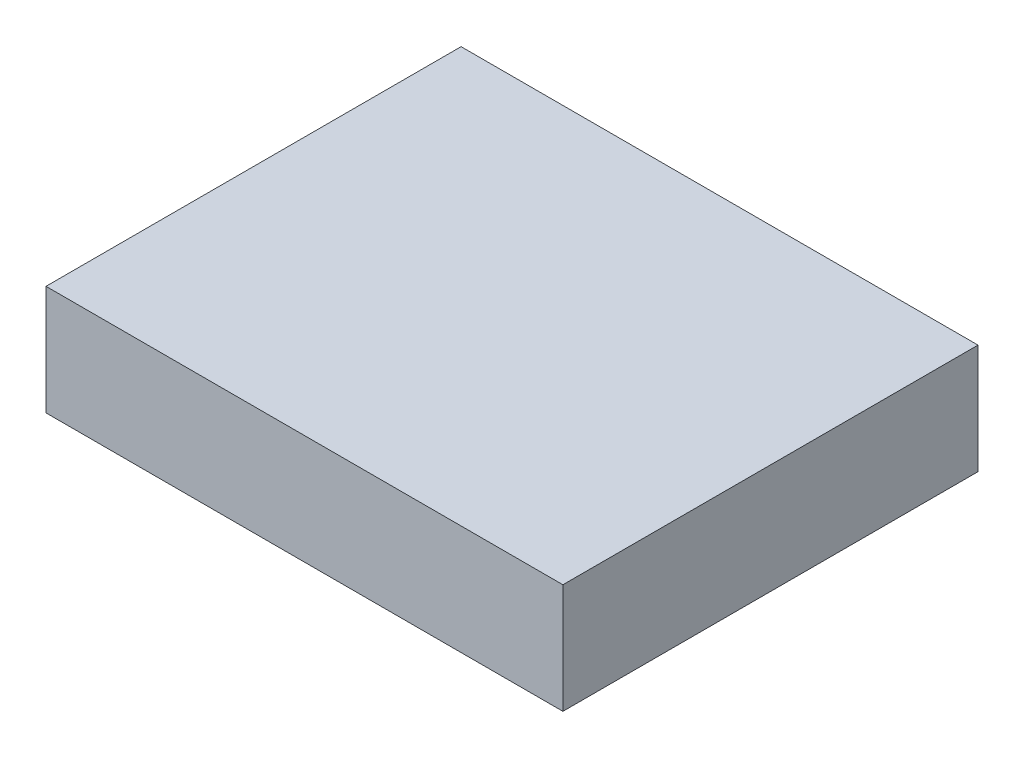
ISO-10303-21;
HEADER;
FILE_DESCRIPTION(('STEP AP214'),'2;1');
FILE_NAME('part.step','',(''),(''),'','','');
FILE_SCHEMA(('AUTOMOTIVE_DESIGN { 1 0 10303 214 1 1 1 1 }'));
ENDSEC;
DATA;
#1=APPLICATION_CONTEXT('core data for automotive mechanical design processes');
#2=APPLICATION_PROTOCOL_DEFINITION('international standard','automotive_design',2000,#1);
#3=PRODUCT_CONTEXT('',#1,'mechanical');
#4=PRODUCT('Part','Part','',(#3));
#5=PRODUCT_RELATED_PRODUCT_CATEGORY('part','',(#4));
#6=PRODUCT_DEFINITION_FORMATION('','',#4);
#7=PRODUCT_DEFINITION_CONTEXT('part definition',#1,'design');
#8=PRODUCT_DEFINITION('design','',#6,#7);
#9=PRODUCT_DEFINITION_SHAPE('','',#8);
#10=(LENGTH_UNIT() NAMED_UNIT(*) SI_UNIT(.MILLI.,.METRE.));
#11=(NAMED_UNIT(*) PLANE_ANGLE_UNIT() SI_UNIT($,.RADIAN.));
#12=(NAMED_UNIT(*) SI_UNIT($,.STERADIAN.) SOLID_ANGLE_UNIT());
#13=UNCERTAINTY_MEASURE_WITH_UNIT(LENGTH_MEASURE(1.E-05),#10,'distance_accuracy_value','');
#14=(GEOMETRIC_REPRESENTATION_CONTEXT(3) GLOBAL_UNCERTAINTY_ASSIGNED_CONTEXT((#13)) GLOBAL_UNIT_ASSIGNED_CONTEXT((#10,
#11,#12)) REPRESENTATION_CONTEXT('',''));
#15=CARTESIAN_POINT('',(0.,0.,0.));
#16=DIRECTION('',(0.,0.,1.));
#17=DIRECTION('',(1.,0.,0.));
#18=AXIS2_PLACEMENT_3D('',#15,#16,#17);
#19=CARTESIAN_POINT('',(0.,14.,0.));
#20=DIRECTION('',(1.,0.,0.));
#21=DIRECTION('',(0.,0.,-1.));
#22=AXIS2_PLACEMENT_3D('',#19,#20,#21);
#23=PLANE('',#22);
#24=DIRECTION('',(0.,0.,1.));
#25=VECTOR('',#24,1.);
#26=CARTESIAN_POINT('',(0.,0.,0.));
#27=LINE('',#26,#25);
#28=CARTESIAN_POINT('',(0.,0.,-53.));
#29=VERTEX_POINT('',#28);
#30=CARTESIAN_POINT('',(0.,0.,0.));
#31=VERTEX_POINT('',#30);
#32=EDGE_CURVE('E107',#29,#31,#27,.T.);
#33=ORIENTED_EDGE('',*,*,#32,.T.);
#34=DIRECTION('',(0.,-1.,0.));
#35=VECTOR('',#34,1.);
#36=CARTESIAN_POINT('',(0.,14.,0.));
#37=LINE('',#36,#35);
#38=CARTESIAN_POINT('',(0.,14.,0.));
#39=VERTEX_POINT('',#38);
#40=EDGE_CURVE('E11',#39,#31,#37,.T.);
#41=ORIENTED_EDGE('',*,*,#40,.F.);
#42=DIRECTION('',(0.,0.,1.));
#43=VECTOR('',#42,1.);
#44=CARTESIAN_POINT('',(0.,14.,0.));
#45=LINE('',#44,#43);
#46=CARTESIAN_POINT('',(0.,14.,-53.));
#47=VERTEX_POINT('',#46);
#48=EDGE_CURVE('E91',#47,#39,#45,.T.);
#49=ORIENTED_EDGE('',*,*,#48,.F.);
#50=DIRECTION('',(0.,-1.,0.));
#51=VECTOR('',#50,1.);
#52=CARTESIAN_POINT('',(0.,14.,-53.));
#53=LINE('',#52,#51);
#54=EDGE_CURVE('E103',#47,#29,#53,.T.);
#55=ORIENTED_EDGE('',*,*,#54,.T.);
#56=EDGE_LOOP('',(#33,#41,#49,#55));
#57=FACE_BOUND('',#56,.T.);
#58=ADVANCED_FACE('F39',(#57),#23,.F.);
#59=CARTESIAN_POINT('',(0.,14.,0.));
#60=DIRECTION('',(0.,0.,-1.));
#61=DIRECTION('',(-1.,0.,0.));
#62=AXIS2_PLACEMENT_3D('',#59,#60,#61);
#63=PLANE('',#62);
#64=DIRECTION('',(1.,0.,0.));
#65=VECTOR('',#64,1.);
#66=CARTESIAN_POINT('',(0.,0.,0.));
#67=LINE('',#66,#65);
#68=CARTESIAN_POINT('',(66.,0.,0.));
#69=VERTEX_POINT('',#68);
#70=EDGE_CURVE('E96',#31,#69,#67,.T.);
#71=ORIENTED_EDGE('',*,*,#70,.T.);
#72=DIRECTION('',(0.,-1.,0.));
#73=VECTOR('',#72,1.);
#74=CARTESIAN_POINT('',(66.,14.,0.));
#75=LINE('',#74,#73);
#76=CARTESIAN_POINT('',(66.,14.,0.));
#77=VERTEX_POINT('',#76);
#78=EDGE_CURVE('E48',#77,#69,#75,.T.);
#79=ORIENTED_EDGE('',*,*,#78,.F.);
#80=DIRECTION('',(1.,0.,0.));
#81=VECTOR('',#80,1.);
#82=CARTESIAN_POINT('',(0.,14.,0.));
#83=LINE('',#82,#81);
#84=EDGE_CURVE('E86',#39,#77,#83,.T.);
#85=ORIENTED_EDGE('',*,*,#84,.F.);
#86=ORIENTED_EDGE('',*,*,#40,.T.);
#87=EDGE_LOOP('',(#71,#79,#85,#86));
#88=FACE_BOUND('',#87,.T.);
#89=ADVANCED_FACE('F95',(#88),#63,.F.);
#90=CARTESIAN_POINT('',(66.,14.,0.));
#91=DIRECTION('',(-1.,0.,0.));
#92=DIRECTION('',(0.,0.,1.));
#93=AXIS2_PLACEMENT_3D('',#90,#91,#92);
#94=PLANE('',#93);
#95=DIRECTION('',(0.,0.,-1.));
#96=VECTOR('',#95,1.);
#97=CARTESIAN_POINT('',(66.,0.,0.));
#98=LINE('',#97,#96);
#99=CARTESIAN_POINT('',(66.,0.,-53.));
#100=VERTEX_POINT('',#99);
#101=EDGE_CURVE('E73',#69,#100,#98,.T.);
#102=ORIENTED_EDGE('',*,*,#101,.T.);
#103=DIRECTION('',(0.,-1.,0.));
#104=VECTOR('',#103,1.);
#105=CARTESIAN_POINT('',(66.,14.,-53.));
#106=LINE('',#105,#104);
#107=CARTESIAN_POINT('',(66.,14.,-53.));
#108=VERTEX_POINT('',#107);
#109=EDGE_CURVE('E98',#108,#100,#106,.T.);
#110=ORIENTED_EDGE('',*,*,#109,.F.);
#111=DIRECTION('',(0.,0.,-1.));
#112=VECTOR('',#111,1.);
#113=CARTESIAN_POINT('',(66.,14.,0.));
#114=LINE('',#113,#112);
#115=EDGE_CURVE('E89',#77,#108,#114,.T.);
#116=ORIENTED_EDGE('',*,*,#115,.F.);
#117=ORIENTED_EDGE('',*,*,#78,.T.);
#118=EDGE_LOOP('',(#102,#110,#116,#117));
#119=FACE_BOUND('',#118,.T.);
#120=ADVANCED_FACE('F99',(#119),#94,.F.);
#121=CARTESIAN_POINT('',(0.,14.,-53.));
#122=DIRECTION('',(0.,0.,1.));
#123=DIRECTION('',(1.,0.,0.));
#124=AXIS2_PLACEMENT_3D('',#121,#122,#123);
#125=PLANE('',#124);
#126=DIRECTION('',(-1.,0.,0.));
#127=VECTOR('',#126,1.);
#128=CARTESIAN_POINT('',(0.,0.,-53.));
#129=LINE('',#128,#127);
#130=EDGE_CURVE('E79',#100,#29,#129,.T.);
#131=ORIENTED_EDGE('',*,*,#130,.T.);
#132=ORIENTED_EDGE('',*,*,#54,.F.);
#133=DIRECTION('',(-1.,0.,0.));
#134=VECTOR('',#133,1.);
#135=CARTESIAN_POINT('',(0.,14.,-53.));
#136=LINE('',#135,#134);
#137=EDGE_CURVE('E56',#108,#47,#136,.T.);
#138=ORIENTED_EDGE('',*,*,#137,.F.);
#139=ORIENTED_EDGE('',*,*,#109,.T.);
#140=EDGE_LOOP('',(#131,#132,#138,#139));
#141=FACE_BOUND('',#140,.T.);
#142=ADVANCED_FACE('F120',(#141),#125,.F.);
#143=CARTESIAN_POINT('',(0.,14.,0.));
#144=DIRECTION('',(0.,-1.,0.));
#145=DIRECTION('',(0.,0.,-1.));
#146=AXIS2_PLACEMENT_3D('',#143,#144,#145);
#147=PLANE('',#146);
#148=ORIENTED_EDGE('',*,*,#48,.T.);
#149=ORIENTED_EDGE('',*,*,#84,.T.);
#150=ORIENTED_EDGE('',*,*,#115,.T.);
#151=ORIENTED_EDGE('',*,*,#137,.T.);
#152=EDGE_LOOP('',(#148,#149,#150,#151));
#153=FACE_BOUND('',#152,.T.);
#154=ADVANCED_FACE('F87',(#153),#147,.F.);
#155=CARTESIAN_POINT('',(0.,0.,0.));
#156=DIRECTION('',(0.,-1.,0.));
#157=DIRECTION('',(0.,0.,-1.));
#158=AXIS2_PLACEMENT_3D('',#155,#156,#157);
#159=PLANE('',#158);
#160=ORIENTED_EDGE('',*,*,#32,.F.);
#161=ORIENTED_EDGE('',*,*,#130,.F.);
#162=ORIENTED_EDGE('',*,*,#101,.F.);
#163=ORIENTED_EDGE('',*,*,#70,.F.);
#164=EDGE_LOOP('',(#160,#161,#162,#163));
#165=FACE_BOUND('',#164,.T.);
#166=ADVANCED_FACE('F123',(#165),#159,.T.);
#167=CLOSED_SHELL('',(#58,#89,#120,#142,#154,#166));
#168=MANIFOLD_SOLID_BREP('B2',#167);
#169=ADVANCED_BREP_SHAPE_REPRESENTATION('',(#18,#168),#14);
#170=SHAPE_DEFINITION_REPRESENTATION(#9,#169);
ENDSEC;
END-ISO-10303-21;
